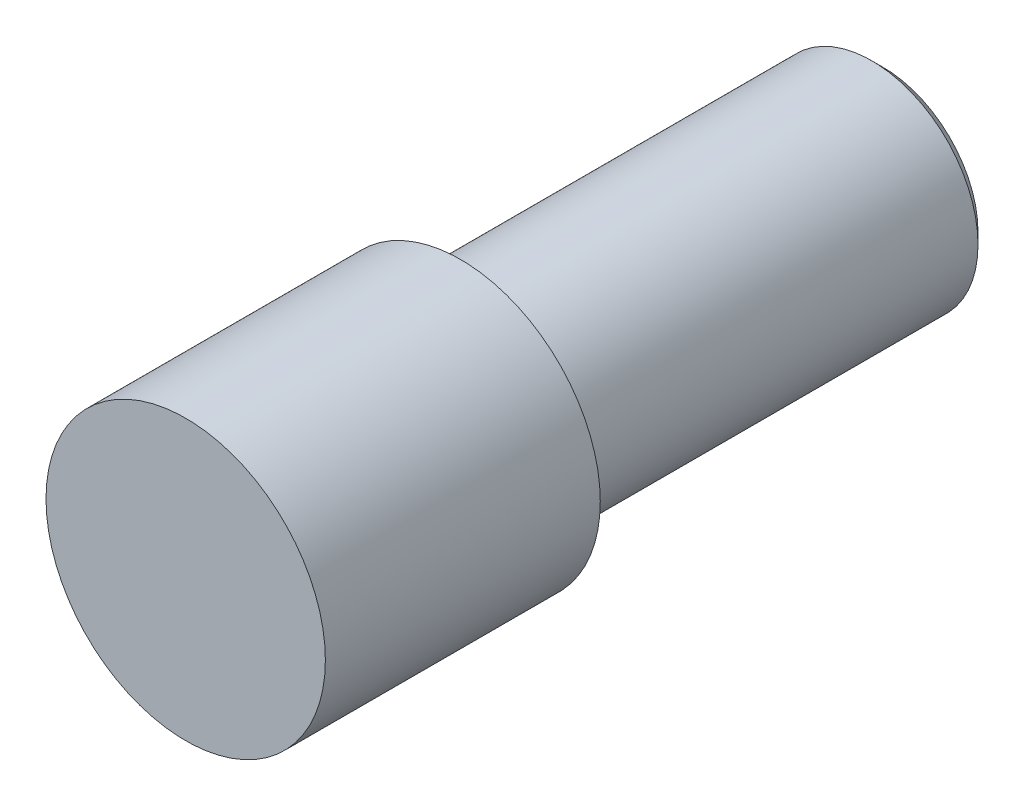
ISO-10303-21;
HEADER;
FILE_DESCRIPTION(('STEP AP214'),'2;1');
FILE_NAME('part.step','',(''),(''),'','','');
FILE_SCHEMA(('AUTOMOTIVE_DESIGN { 1 0 10303 214 1 1 1 1 }'));
ENDSEC;
DATA;
#1=APPLICATION_CONTEXT('core data for automotive mechanical design processes');
#2=APPLICATION_PROTOCOL_DEFINITION('international standard','automotive_design',2000,#1);
#3=PRODUCT_CONTEXT('',#1,'mechanical');
#4=PRODUCT('Part','Part','',(#3));
#5=PRODUCT_RELATED_PRODUCT_CATEGORY('part','',(#4));
#6=PRODUCT_DEFINITION_FORMATION('','',#4);
#7=PRODUCT_DEFINITION_CONTEXT('part definition',#1,'design');
#8=PRODUCT_DEFINITION('design','',#6,#7);
#9=PRODUCT_DEFINITION_SHAPE('','',#8);
#10=(LENGTH_UNIT() NAMED_UNIT(*) SI_UNIT(.MILLI.,.METRE.));
#11=(NAMED_UNIT(*) PLANE_ANGLE_UNIT() SI_UNIT($,.RADIAN.));
#12=(NAMED_UNIT(*) SI_UNIT($,.STERADIAN.) SOLID_ANGLE_UNIT());
#13=UNCERTAINTY_MEASURE_WITH_UNIT(LENGTH_MEASURE(1.E-05),#10,'distance_accuracy_value','');
#14=(GEOMETRIC_REPRESENTATION_CONTEXT(3) GLOBAL_UNCERTAINTY_ASSIGNED_CONTEXT((#13)) GLOBAL_UNIT_ASSIGNED_CONTEXT((#10,
#11,#12)) REPRESENTATION_CONTEXT('',''));
#15=CARTESIAN_POINT('',(0.,0.,0.));
#16=DIRECTION('',(0.,0.,1.));
#17=DIRECTION('',(1.,0.,0.));
#18=AXIS2_PLACEMENT_3D('',#15,#16,#17);
#19=CARTESIAN_POINT('',(0.,0.,0.));
#20=DIRECTION('',(0.,0.,-1.));
#21=DIRECTION('',(-1.,0.,0.));
#22=AXIS2_PLACEMENT_3D('',#19,#20,#21);
#23=PLANE('',#22);
#24=CARTESIAN_POINT('',(0.,0.,0.));
#25=DIRECTION('',(0.,0.,1.));
#26=DIRECTION('',(1.,0.,0.));
#27=AXIS2_PLACEMENT_3D('',#24,#25,#26);
#28=CIRCLE('',#27,1.5875);
#29=CARTESIAN_POINT('',(1.5875,0.,0.));
#30=VERTEX_POINT('',#29);
#31=EDGE_CURVE('E10',#30,#30,#28,.T.);
#32=ORIENTED_EDGE('',*,*,#31,.T.);
#33=EDGE_LOOP('',(#32));
#34=FACE_BOUND('',#33,.T.);
#35=ADVANCED_FACE('F35',(#34),#23,.F.);
#36=CARTESIAN_POINT('',(0.,0.,0.));
#37=DIRECTION('',(0.,0.,1.));
#38=DIRECTION('',(1.,0.,0.));
#39=AXIS2_PLACEMENT_3D('',#36,#37,#38);
#40=CYLINDRICAL_SURFACE('',#39,1.5875);
#41=ORIENTED_EDGE('',*,*,#31,.F.);
#42=EDGE_LOOP('',(#41));
#43=FACE_BOUND('',#42,.T.);
#44=CARTESIAN_POINT('',(0.,0.,-3.1242));
#45=DIRECTION('',(0.,0.,1.));
#46=DIRECTION('',(1.,0.,0.));
#47=AXIS2_PLACEMENT_3D('',#44,#45,#46);
#48=CIRCLE('',#47,1.5875);
#49=CARTESIAN_POINT('',(1.5875,0.,-3.1242));
#50=VERTEX_POINT('',#49);
#51=EDGE_CURVE('E41',#50,#50,#48,.T.);
#52=ORIENTED_EDGE('',*,*,#51,.T.);
#53=EDGE_LOOP('',(#52));
#54=FACE_BOUND('',#53,.T.);
#55=ADVANCED_FACE('F70',(#43,#54),#40,.T.);
#56=CARTESIAN_POINT('',(0.,1.5875,-3.1242));
#57=DIRECTION('',(0.,0.,1.));
#58=DIRECTION('',(1.,0.,0.));
#59=AXIS2_PLACEMENT_3D('',#56,#57,#58);
#60=PLANE('',#59);
#61=ORIENTED_EDGE('',*,*,#51,.F.);
#62=EDGE_LOOP('',(#61));
#63=FACE_BOUND('',#62,.T.);
#64=CARTESIAN_POINT('',(0.,0.,-3.1242));
#65=DIRECTION('',(0.,0.,1.));
#66=DIRECTION('',(1.,0.,0.));
#67=AXIS2_PLACEMENT_3D('',#64,#65,#66);
#68=CIRCLE('',#67,1.2065);
#69=CARTESIAN_POINT('',(1.2065,0.,-3.1242));
#70=VERTEX_POINT('',#69);
#71=EDGE_CURVE('E45',#70,#70,#68,.T.);
#72=ORIENTED_EDGE('',*,*,#71,.T.);
#73=EDGE_LOOP('',(#72));
#74=FACE_BOUND('',#73,.T.);
#75=ADVANCED_FACE('F74',(#63,#74),#60,.F.);
#76=CARTESIAN_POINT('',(0.,0.,0.));
#77=DIRECTION('',(0.,0.,1.));
#78=DIRECTION('',(1.,0.,0.));
#79=AXIS2_PLACEMENT_3D('',#76,#77,#78);
#80=CYLINDRICAL_SURFACE('',#79,1.2065);
#81=ORIENTED_EDGE('',*,*,#71,.F.);
#82=EDGE_LOOP('',(#81));
#83=FACE_BOUND('',#82,.T.);
#84=CARTESIAN_POINT('',(0.,0.,-7.7978));
#85=DIRECTION('',(0.,0.,1.));
#86=DIRECTION('',(1.,0.,0.));
#87=AXIS2_PLACEMENT_3D('',#84,#85,#86);
#88=CIRCLE('',#87,1.2065);
#89=CARTESIAN_POINT('',(1.2065,0.,-7.7978));
#90=VERTEX_POINT('',#89);
#91=EDGE_CURVE('E49',#90,#90,#88,.T.);
#92=ORIENTED_EDGE('',*,*,#91,.T.);
#93=EDGE_LOOP('',(#92));
#94=FACE_BOUND('',#93,.T.);
#95=ADVANCED_FACE('F66',(#83,#94),#80,.T.);
#96=CARTESIAN_POINT('',(0.,0.,-7.9248));
#97=DIRECTION('',(0.,0.,1.));
#98=DIRECTION('',(1.,0.,0.));
#99=AXIS2_PLACEMENT_3D('',#96,#97,#98);
#100=CONICAL_SURFACE('',#99,1.0795,0.785398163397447);
#101=ORIENTED_EDGE('',*,*,#91,.F.);
#102=EDGE_LOOP('',(#101));
#103=FACE_BOUND('',#102,.T.);
#104=CARTESIAN_POINT('',(0.,0.,-7.9248));
#105=DIRECTION('',(0.,0.,1.));
#106=DIRECTION('',(1.,0.,0.));
#107=AXIS2_PLACEMENT_3D('',#104,#105,#106);
#108=CIRCLE('',#107,1.0795);
#109=CARTESIAN_POINT('',(1.0795,0.,-7.9248));
#110=VERTEX_POINT('',#109);
#111=EDGE_CURVE('E54',#110,#110,#108,.T.);
#112=ORIENTED_EDGE('',*,*,#111,.T.);
#113=EDGE_LOOP('',(#112));
#114=FACE_BOUND('',#113,.T.);
#115=ADVANCED_FACE('F58',(#103,#114),#100,.T.);
#116=CARTESIAN_POINT('',(0.,1.0795,-7.9248));
#117=DIRECTION('',(0.,0.,1.));
#118=DIRECTION('',(1.,0.,0.));
#119=AXIS2_PLACEMENT_3D('',#116,#117,#118);
#120=PLANE('',#119);
#121=ORIENTED_EDGE('',*,*,#111,.F.);
#122=EDGE_LOOP('',(#121));
#123=FACE_BOUND('',#122,.T.);
#124=ADVANCED_FACE('F60',(#123),#120,.F.);
#125=CLOSED_SHELL('',(#35,#55,#75,#95,#115,#124));
#126=MANIFOLD_SOLID_BREP('B2',#125);
#127=ADVANCED_BREP_SHAPE_REPRESENTATION('',(#18,#126),#14);
#128=SHAPE_DEFINITION_REPRESENTATION(#9,#127);
ENDSEC;
END-ISO-10303-21;
